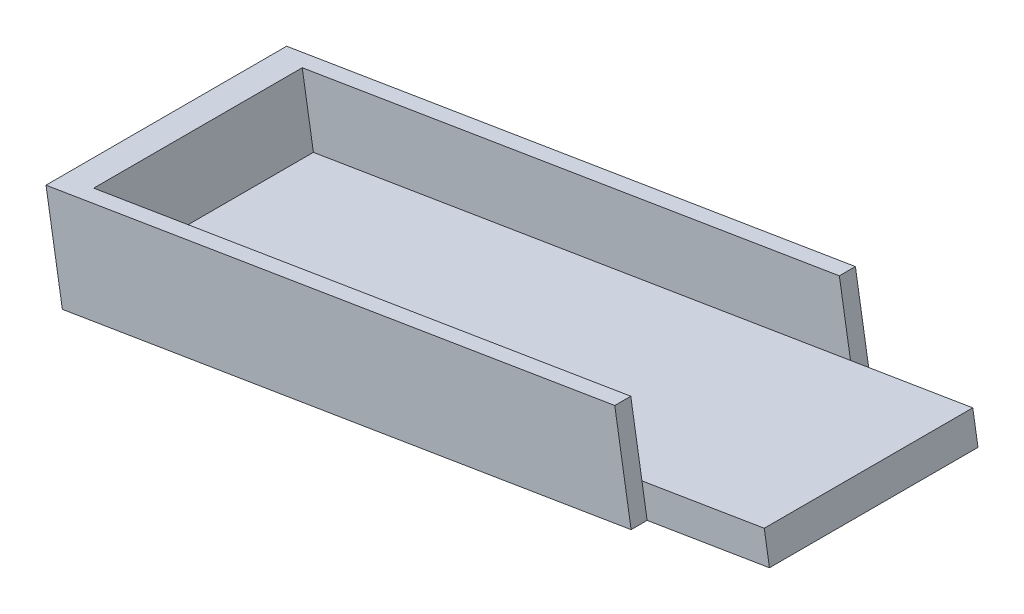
from build123d import *

# Parameters (mm, degrees)
EXTRUDE_THIN1_DEPTH = 32.5
BOSS_EXTRUDE1_DEPTH = 5
BOSS_EXTRUDE2_DEPTH = 5


with BuildPart() as part:
    # Sketch1 → Extrude-Thin1 (new, symmetric)
    with BuildSketch(Plane.XY):
        Polygon((0, -38.451191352), (-215.379762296, -73.879066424), (-220.474757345, -42.904619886), (-210.607357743, -41.281528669), (-207.135453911, -62.388575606), (-1.623091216, -28.58379175), align=None)
    extrude(amount=EXTRUDE_THIN1_DEPTH, both=True)

    # Sketch2 → Boss-Extrude1 (add)
    with BuildSketch(Plane(origin=(0, 0, -32.5), x_dir=(-1, 0, 0), z_dir=(0, 0, -1))):
        Polygon((220.474757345, -42.904619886), (215.379762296, -73.879066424), (38.117242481, -44.721106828), (43.212237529, -13.746660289), align=None)
    extrude(amount=BOSS_EXTRUDE1_DEPTH)

    # Sketch3 → Boss-Extrude2 (add)
    with BuildSketch(Plane.XY.offset(32.5)):
        Polygon((-220.474757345, -42.904619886), (-43.212237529, -13.746660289), (-38.117242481, -44.721106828), (-215.379762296, -73.879066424), align=None)
    extrude(amount=BOSS_EXTRUDE2_DEPTH)


solid = part.part
